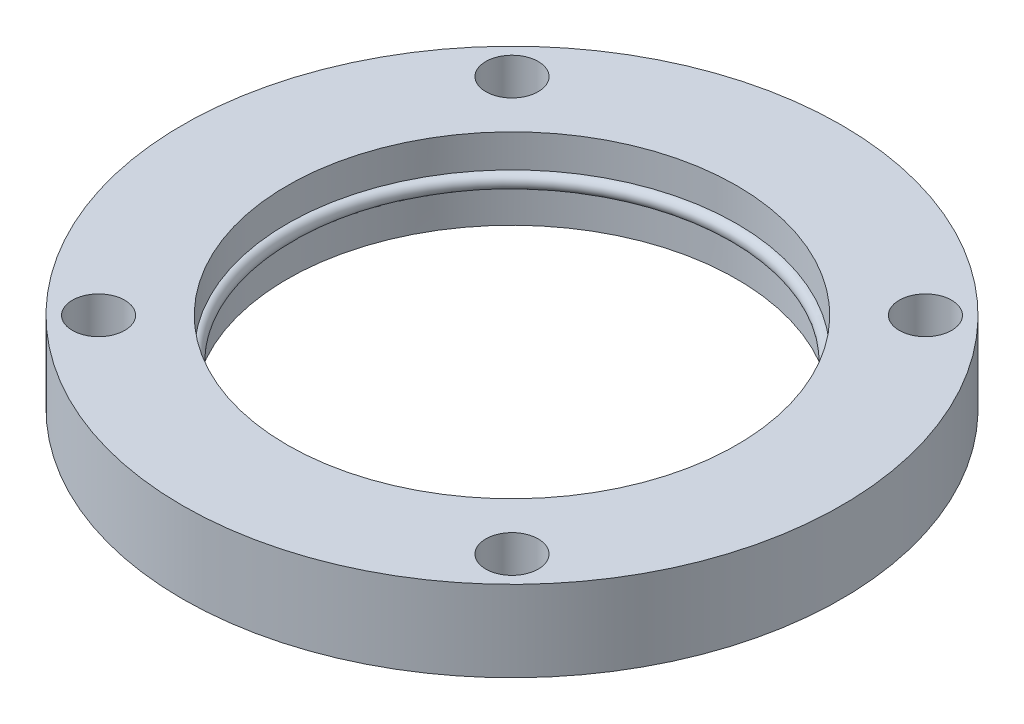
ISO-10303-21;
HEADER;
FILE_DESCRIPTION(('STEP AP214'),'2;1');
FILE_NAME('part.step','',(''),(''),'','','');
FILE_SCHEMA(('AUTOMOTIVE_DESIGN { 1 0 10303 214 1 1 1 1 }'));
ENDSEC;
DATA;
#1=APPLICATION_CONTEXT('core data for automotive mechanical design processes');
#2=APPLICATION_PROTOCOL_DEFINITION('international standard','automotive_design',2000,#1);
#3=PRODUCT_CONTEXT('',#1,'mechanical');
#4=PRODUCT('Part','Part','',(#3));
#5=PRODUCT_RELATED_PRODUCT_CATEGORY('part','',(#4));
#6=PRODUCT_DEFINITION_FORMATION('','',#4);
#7=PRODUCT_DEFINITION_CONTEXT('part definition',#1,'design');
#8=PRODUCT_DEFINITION('design','',#6,#7);
#9=PRODUCT_DEFINITION_SHAPE('','',#8);
#10=(LENGTH_UNIT() NAMED_UNIT(*) SI_UNIT(.MILLI.,.METRE.));
#11=(NAMED_UNIT(*) PLANE_ANGLE_UNIT() SI_UNIT($,.RADIAN.));
#12=(NAMED_UNIT(*) SI_UNIT($,.STERADIAN.) SOLID_ANGLE_UNIT());
#13=UNCERTAINTY_MEASURE_WITH_UNIT(LENGTH_MEASURE(1.E-05),#10,'distance_accuracy_value','');
#14=(GEOMETRIC_REPRESENTATION_CONTEXT(3) GLOBAL_UNCERTAINTY_ASSIGNED_CONTEXT((#13)) GLOBAL_UNIT_ASSIGNED_CONTEXT((#10,
#11,#12)) REPRESENTATION_CONTEXT('',''));
#15=CARTESIAN_POINT('',(0.,0.,0.));
#16=DIRECTION('',(0.,0.,1.));
#17=DIRECTION('',(1.,0.,0.));
#18=AXIS2_PLACEMENT_3D('',#15,#16,#17);
#19=CARTESIAN_POINT('',(0.,13.5,0.));
#20=DIRECTION('',(0.,-1.,0.));
#21=DIRECTION('',(0.,0.,-1.));
#22=AXIS2_PLACEMENT_3D('',#19,#20,#21);
#23=CYLINDRICAL_SURFACE('',#22,75.);
#24=CARTESIAN_POINT('',(0.,-13.5,0.));
#25=DIRECTION('',(0.,1.,0.));
#26=DIRECTION('',(0.,0.,1.));
#27=AXIS2_PLACEMENT_3D('',#24,#25,#26);
#28=CIRCLE('',#27,75.);
#29=CARTESIAN_POINT('',(0.,-13.5,75.));
#30=VERTEX_POINT('',#29);
#31=EDGE_CURVE('E49',#30,#30,#28,.T.);
#32=ORIENTED_EDGE('',*,*,#31,.F.);
#33=EDGE_LOOP('',(#32));
#34=FACE_BOUND('',#33,.T.);
#35=CARTESIAN_POINT('',(0.,-2.49999999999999,0.));
#36=DIRECTION('',(0.,1.,0.));
#37=DIRECTION('',(0.,0.,1.));
#38=AXIS2_PLACEMENT_3D('',#35,#36,#37);
#39=CIRCLE('',#38,75.);
#40=CARTESIAN_POINT('',(0.,-2.49999999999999,75.));
#41=VERTEX_POINT('',#40);
#42=EDGE_CURVE('E37',#41,#41,#39,.T.);
#43=ORIENTED_EDGE('',*,*,#42,.T.);
#44=EDGE_LOOP('',(#43));
#45=FACE_BOUND('',#44,.T.);
#46=ADVANCED_FACE('F33',(#34,#45),#23,.F.);
#47=CARTESIAN_POINT('',(0.,13.5,0.));
#48=DIRECTION('',(0.,1.,0.));
#49=DIRECTION('',(0.,0.,1.));
#50=AXIS2_PLACEMENT_3D('',#47,#48,#49);
#51=CIRCLE('',#50,75.);
#52=CARTESIAN_POINT('',(0.,13.5,75.));
#53=VERTEX_POINT('',#52);
#54=EDGE_CURVE('E46',#53,#53,#51,.T.);
#55=ORIENTED_EDGE('',*,*,#54,.T.);
#56=EDGE_LOOP('',(#55));
#57=FACE_BOUND('',#56,.T.);
#58=CARTESIAN_POINT('',(0.,2.49999999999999,0.));
#59=DIRECTION('',(0.,-1.,0.));
#60=DIRECTION('',(0.,0.,-1.));
#61=AXIS2_PLACEMENT_3D('',#58,#59,#60);
#62=CIRCLE('',#61,75.);
#63=CARTESIAN_POINT('',(0.,2.49999999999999,-75.));
#64=VERTEX_POINT('',#63);
#65=EDGE_CURVE('E51',#64,#64,#62,.T.);
#66=ORIENTED_EDGE('',*,*,#65,.T.);
#67=EDGE_LOOP('',(#66));
#68=FACE_BOUND('',#67,.T.);
#69=ADVANCED_FACE('F94',(#57,#68),#23,.F.);
#70=CARTESIAN_POINT('',(0.,13.5,0.));
#71=DIRECTION('',(0.,1.,0.));
#72=DIRECTION('',(0.,0.,1.));
#73=AXIS2_PLACEMENT_3D('',#70,#71,#72);
#74=PLANE('',#73);
#75=CARTESIAN_POINT('',(69.,13.5,69.));
#76=DIRECTION('',(0.,1.,0.));
#77=DIRECTION('',(0.,0.,1.));
#78=AXIS2_PLACEMENT_3D('',#75,#76,#77);
#79=CIRCLE('',#78,8.75000000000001);
#80=CARTESIAN_POINT('',(69.,13.5,77.75));
#81=VERTEX_POINT('',#80);
#82=EDGE_CURVE('E68',#81,#81,#79,.T.);
#83=ORIENTED_EDGE('',*,*,#82,.F.);
#84=EDGE_LOOP('',(#83));
#85=FACE_BOUND('',#84,.T.);
#86=CARTESIAN_POINT('',(-69.,13.5,-69.));
#87=DIRECTION('',(0.,1.,0.));
#88=DIRECTION('',(0.,0.,1.));
#89=AXIS2_PLACEMENT_3D('',#86,#87,#88);
#90=CIRCLE('',#89,8.75000000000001);
#91=CARTESIAN_POINT('',(-69.,13.5,-60.25));
#92=VERTEX_POINT('',#91);
#93=EDGE_CURVE('E80',#92,#92,#90,.T.);
#94=ORIENTED_EDGE('',*,*,#93,.F.);
#95=EDGE_LOOP('',(#94));
#96=FACE_BOUND('',#95,.T.);
#97=CARTESIAN_POINT('',(0.,13.5,0.));
#98=DIRECTION('',(0.,1.,0.));
#99=DIRECTION('',(0.,0.,1.));
#100=AXIS2_PLACEMENT_3D('',#97,#98,#99);
#101=CIRCLE('',#100,110.);
#102=CARTESIAN_POINT('',(0.,13.5,110.));
#103=VERTEX_POINT('',#102);
#104=EDGE_CURVE('E10',#103,#103,#101,.T.);
#105=ORIENTED_EDGE('',*,*,#104,.T.);
#106=EDGE_LOOP('',(#105));
#107=FACE_BOUND('',#106,.T.);
#108=ORIENTED_EDGE('',*,*,#54,.F.);
#109=EDGE_LOOP('',(#108));
#110=FACE_BOUND('',#109,.T.);
#111=CARTESIAN_POINT('',(69.,13.5,-69.));
#112=DIRECTION('',(0.,1.,0.));
#113=DIRECTION('',(0.,0.,1.));
#114=AXIS2_PLACEMENT_3D('',#111,#112,#113);
#115=CIRCLE('',#114,8.75000000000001);
#116=CARTESIAN_POINT('',(69.,13.5,-60.25));
#117=VERTEX_POINT('',#116);
#118=EDGE_CURVE('E74',#117,#117,#115,.T.);
#119=ORIENTED_EDGE('',*,*,#118,.F.);
#120=EDGE_LOOP('',(#119));
#121=FACE_BOUND('',#120,.T.);
#122=CARTESIAN_POINT('',(-69.,13.5,69.));
#123=DIRECTION('',(0.,1.,0.));
#124=DIRECTION('',(0.,0.,1.));
#125=AXIS2_PLACEMENT_3D('',#122,#123,#124);
#126=CIRCLE('',#125,8.75000000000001);
#127=CARTESIAN_POINT('',(-69.,13.5,77.75));
#128=VERTEX_POINT('',#127);
#129=EDGE_CURVE('E60',#128,#128,#126,.T.);
#130=ORIENTED_EDGE('',*,*,#129,.F.);
#131=EDGE_LOOP('',(#130));
#132=FACE_BOUND('',#131,.T.);
#133=ADVANCED_FACE('F99',(#85,#96,#107,#110,#121,#132),#74,.T.);
#134=CARTESIAN_POINT('',(0.,-13.5,0.));
#135=DIRECTION('',(0.,1.,0.));
#136=DIRECTION('',(0.,0.,1.));
#137=AXIS2_PLACEMENT_3D('',#134,#135,#136);
#138=PLANE('',#137);
#139=CARTESIAN_POINT('',(0.,-13.5,0.));
#140=DIRECTION('',(0.,1.,0.));
#141=DIRECTION('',(0.,0.,1.));
#142=AXIS2_PLACEMENT_3D('',#139,#140,#141);
#143=CIRCLE('',#142,110.);
#144=CARTESIAN_POINT('',(0.,-13.5,110.));
#145=VERTEX_POINT('',#144);
#146=EDGE_CURVE('E41',#145,#145,#143,.T.);
#147=ORIENTED_EDGE('',*,*,#146,.F.);
#148=EDGE_LOOP('',(#147));
#149=FACE_BOUND('',#148,.T.);
#150=ORIENTED_EDGE('',*,*,#31,.T.);
#151=EDGE_LOOP('',(#150));
#152=FACE_BOUND('',#151,.T.);
#153=CARTESIAN_POINT('',(-69.,-13.5,-69.));
#154=DIRECTION('',(0.,1.,0.));
#155=DIRECTION('',(0.,0.,1.));
#156=AXIS2_PLACEMENT_3D('',#153,#154,#155);
#157=CIRCLE('',#156,8.75000000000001);
#158=CARTESIAN_POINT('',(-69.,-13.5,-60.25));
#159=VERTEX_POINT('',#158);
#160=EDGE_CURVE('E77',#159,#159,#157,.T.);
#161=ORIENTED_EDGE('',*,*,#160,.T.);
#162=EDGE_LOOP('',(#161));
#163=FACE_BOUND('',#162,.T.);
#164=CARTESIAN_POINT('',(69.,-13.5,-69.));
#165=DIRECTION('',(0.,1.,0.));
#166=DIRECTION('',(0.,0.,1.));
#167=AXIS2_PLACEMENT_3D('',#164,#165,#166);
#168=CIRCLE('',#167,8.75000000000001);
#169=CARTESIAN_POINT('',(69.,-13.5,-60.25));
#170=VERTEX_POINT('',#169);
#171=EDGE_CURVE('E71',#170,#170,#168,.T.);
#172=ORIENTED_EDGE('',*,*,#171,.T.);
#173=EDGE_LOOP('',(#172));
#174=FACE_BOUND('',#173,.T.);
#175=CARTESIAN_POINT('',(69.,-13.5,69.));
#176=DIRECTION('',(0.,1.,0.));
#177=DIRECTION('',(0.,0.,1.));
#178=AXIS2_PLACEMENT_3D('',#175,#176,#177);
#179=CIRCLE('',#178,8.75000000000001);
#180=CARTESIAN_POINT('',(69.,-13.5,77.75));
#181=VERTEX_POINT('',#180);
#182=EDGE_CURVE('E65',#181,#181,#179,.T.);
#183=ORIENTED_EDGE('',*,*,#182,.T.);
#184=EDGE_LOOP('',(#183));
#185=FACE_BOUND('',#184,.T.);
#186=CARTESIAN_POINT('',(-69.,-13.5,69.));
#187=DIRECTION('',(0.,1.,0.));
#188=DIRECTION('',(0.,0.,1.));
#189=AXIS2_PLACEMENT_3D('',#186,#187,#188);
#190=CIRCLE('',#189,8.75000000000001);
#191=CARTESIAN_POINT('',(-69.,-13.5,77.75));
#192=VERTEX_POINT('',#191);
#193=EDGE_CURVE('E56',#192,#192,#190,.T.);
#194=ORIENTED_EDGE('',*,*,#193,.T.);
#195=EDGE_LOOP('',(#194));
#196=FACE_BOUND('',#195,.T.);
#197=ADVANCED_FACE('F90',(#149,#152,#163,#174,#185,#196),#138,.F.);
#198=CARTESIAN_POINT('',(0.,13.5,0.));
#199=DIRECTION('',(0.,-1.,0.));
#200=DIRECTION('',(0.,0.,-1.));
#201=AXIS2_PLACEMENT_3D('',#198,#199,#200);
#202=CYLINDRICAL_SURFACE('',#201,110.);
#203=ORIENTED_EDGE('',*,*,#104,.F.);
#204=EDGE_LOOP('',(#203));
#205=FACE_BOUND('',#204,.T.);
#206=ORIENTED_EDGE('',*,*,#146,.T.);
#207=EDGE_LOOP('',(#206));
#208=FACE_BOUND('',#207,.T.);
#209=ADVANCED_FACE('F35',(#205,#208),#202,.T.);
#210=CARTESIAN_POINT('',(-69.,13.5,-69.));
#211=DIRECTION('',(0.,-1.,0.));
#212=DIRECTION('',(0.,0.,-1.));
#213=AXIS2_PLACEMENT_3D('',#210,#211,#212);
#214=CYLINDRICAL_SURFACE('',#213,8.75000000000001);
#215=ORIENTED_EDGE('',*,*,#93,.T.);
#216=EDGE_LOOP('',(#215));
#217=FACE_BOUND('',#216,.T.);
#218=ORIENTED_EDGE('',*,*,#160,.F.);
#219=EDGE_LOOP('',(#218));
#220=FACE_BOUND('',#219,.T.);
#221=ADVANCED_FACE('F102',(#217,#220),#214,.F.);
#222=CARTESIAN_POINT('',(69.,13.5,-69.));
#223=DIRECTION('',(0.,-1.,0.));
#224=DIRECTION('',(0.,0.,-1.));
#225=AXIS2_PLACEMENT_3D('',#222,#223,#224);
#226=CYLINDRICAL_SURFACE('',#225,8.75000000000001);
#227=ORIENTED_EDGE('',*,*,#118,.T.);
#228=EDGE_LOOP('',(#227));
#229=FACE_BOUND('',#228,.T.);
#230=ORIENTED_EDGE('',*,*,#171,.F.);
#231=EDGE_LOOP('',(#230));
#232=FACE_BOUND('',#231,.T.);
#233=ADVANCED_FACE('F117',(#229,#232),#226,.F.);
#234=CARTESIAN_POINT('',(69.,13.5,69.));
#235=DIRECTION('',(0.,-1.,0.));
#236=DIRECTION('',(0.,0.,-1.));
#237=AXIS2_PLACEMENT_3D('',#234,#235,#236);
#238=CYLINDRICAL_SURFACE('',#237,8.75000000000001);
#239=ORIENTED_EDGE('',*,*,#82,.T.);
#240=EDGE_LOOP('',(#239));
#241=FACE_BOUND('',#240,.T.);
#242=ORIENTED_EDGE('',*,*,#182,.F.);
#243=EDGE_LOOP('',(#242));
#244=FACE_BOUND('',#243,.T.);
#245=ADVANCED_FACE('F122',(#241,#244),#238,.F.);
#246=CARTESIAN_POINT('',(-69.,13.5,69.));
#247=DIRECTION('',(0.,-1.,0.));
#248=DIRECTION('',(0.,0.,-1.));
#249=AXIS2_PLACEMENT_3D('',#246,#247,#248);
#250=CYLINDRICAL_SURFACE('',#249,8.75000000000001);
#251=ORIENTED_EDGE('',*,*,#129,.T.);
#252=EDGE_LOOP('',(#251));
#253=FACE_BOUND('',#252,.T.);
#254=ORIENTED_EDGE('',*,*,#193,.F.);
#255=EDGE_LOOP('',(#254));
#256=FACE_BOUND('',#255,.T.);
#257=ADVANCED_FACE('F133',(#253,#256),#250,.F.);
#258=CARTESIAN_POINT('',(0.,0.,0.));
#259=DIRECTION('',(0.,-1.,0.));
#260=DIRECTION('',(0.,0.,-1.));
#261=AXIS2_PLACEMENT_3D('',#258,#259,#260);
#262=TOROIDAL_SURFACE('',#261,75.,2.49999999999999);
#263=ORIENTED_EDGE('',*,*,#65,.F.);
#264=EDGE_LOOP('',(#263));
#265=FACE_BOUND('',#264,.T.);
#266=ORIENTED_EDGE('',*,*,#42,.F.);
#267=EDGE_LOOP('',(#266));
#268=FACE_BOUND('',#267,.T.);
#269=ADVANCED_FACE('F139',(#265,#268),#262,.T.);
#270=CLOSED_SHELL('',(#46,#69,#133,#197,#209,#221,#233,#245,#257,#269));
#271=MANIFOLD_SOLID_BREP('B2',#270);
#272=ADVANCED_BREP_SHAPE_REPRESENTATION('',(#18,#271),#14);
#273=SHAPE_DEFINITION_REPRESENTATION(#9,#272);
ENDSEC;
END-ISO-10303-21;
